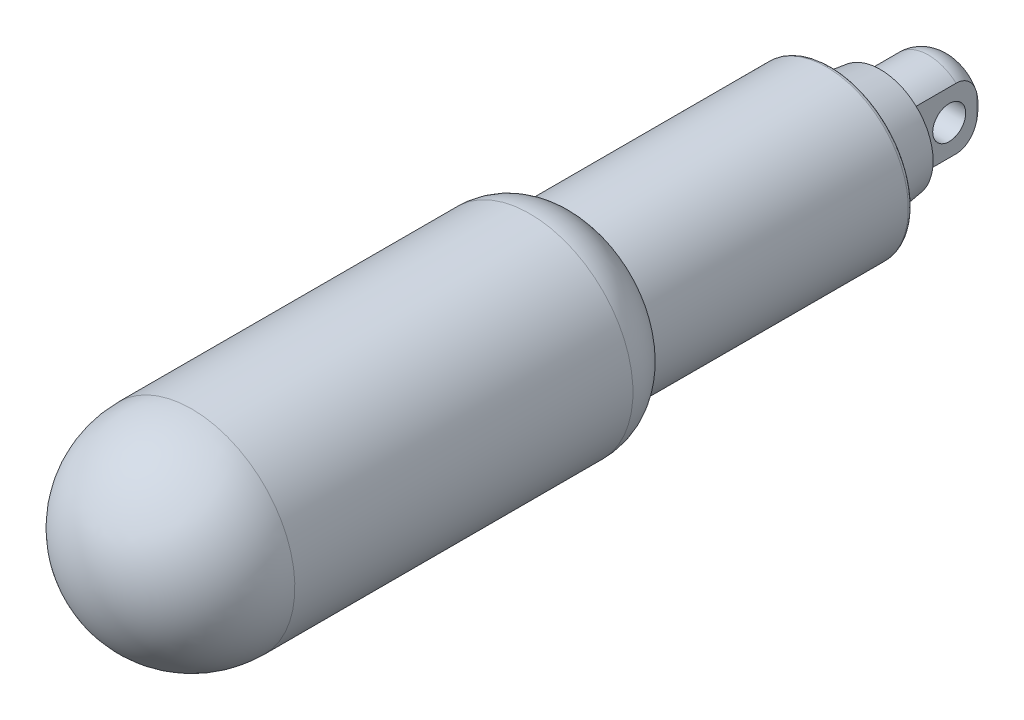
ISO-10303-21;
HEADER;
FILE_DESCRIPTION(('STEP AP214'),'2;1');
FILE_NAME('part.step','',(''),(''),'','','');
FILE_SCHEMA(('AUTOMOTIVE_DESIGN { 1 0 10303 214 1 1 1 1 }'));
ENDSEC;
DATA;
#1=APPLICATION_CONTEXT('core data for automotive mechanical design processes');
#2=APPLICATION_PROTOCOL_DEFINITION('international standard','automotive_design',2000,#1);
#3=PRODUCT_CONTEXT('',#1,'mechanical');
#4=PRODUCT('Part','Part','',(#3));
#5=PRODUCT_RELATED_PRODUCT_CATEGORY('part','',(#4));
#6=PRODUCT_DEFINITION_FORMATION('','',#4);
#7=PRODUCT_DEFINITION_CONTEXT('part definition',#1,'design');
#8=PRODUCT_DEFINITION('design','',#6,#7);
#9=PRODUCT_DEFINITION_SHAPE('','',#8);
#10=(LENGTH_UNIT() NAMED_UNIT(*) SI_UNIT(.MILLI.,.METRE.));
#11=(NAMED_UNIT(*) PLANE_ANGLE_UNIT() SI_UNIT($,.RADIAN.));
#12=(NAMED_UNIT(*) SI_UNIT($,.STERADIAN.) SOLID_ANGLE_UNIT());
#13=UNCERTAINTY_MEASURE_WITH_UNIT(LENGTH_MEASURE(1.E-05),#10,'distance_accuracy_value','');
#14=(GEOMETRIC_REPRESENTATION_CONTEXT(3) GLOBAL_UNCERTAINTY_ASSIGNED_CONTEXT((#13)) GLOBAL_UNIT_ASSIGNED_CONTEXT((#10,
#11,#12)) REPRESENTATION_CONTEXT('',''));
#15=CARTESIAN_POINT('',(0.,0.,0.));
#16=DIRECTION('',(0.,0.,1.));
#17=DIRECTION('',(1.,0.,0.));
#18=AXIS2_PLACEMENT_3D('',#15,#16,#17);
#19=CARTESIAN_POINT('',(0.,-1.,-3.8333333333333));
#20=DIRECTION('',(0.,0.,-1.));
#21=DIRECTION('',(0.,1.,0.));
#22=AXIS2_PLACEMENT_3D('',#19,#20,#21);
#23=PLANE('',#22);
#24=CARTESIAN_POINT('',(0.,0.,-3.8333333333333));
#25=DIRECTION('',(0.,0.,1.));
#26=DIRECTION('',(-1.,0.,0.));
#27=AXIS2_PLACEMENT_3D('',#24,#25,#26);
#28=CIRCLE('',#27,1.99999999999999);
#29=CARTESIAN_POINT('',(-2.,0.,-3.8333333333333));
#30=VERTEX_POINT('',#29);
#31=CARTESIAN_POINT('',(0.,-2.,-3.8333333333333));
#32=VERTEX_POINT('',#31);
#33=EDGE_CURVE('E186',#30,#32,#28,.T.);
#34=ORIENTED_EDGE('',*,*,#33,.F.);
#35=CARTESIAN_POINT('',(0.,0.,-3.8333333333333));
#36=DIRECTION('',(0.,0.,1.));
#37=DIRECTION('',(1.,0.,0.));
#38=AXIS2_PLACEMENT_3D('',#35,#36,#37);
#39=CIRCLE('',#38,2.);
#40=CARTESIAN_POINT('',(2.,0.,-3.8333333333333));
#41=VERTEX_POINT('',#40);
#42=EDGE_CURVE('E81',#41,#30,#39,.T.);
#43=ORIENTED_EDGE('',*,*,#42,.F.);
#44=CARTESIAN_POINT('',(0.,0.,-3.8333333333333));
#45=DIRECTION('',(0.,0.,1.));
#46=DIRECTION('',(0.,-1.,0.));
#47=AXIS2_PLACEMENT_3D('',#44,#45,#46);
#48=CIRCLE('',#47,1.99999999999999);
#49=EDGE_CURVE('E182',#32,#41,#48,.T.);
#50=ORIENTED_EDGE('',*,*,#49,.F.);
#51=EDGE_LOOP('',(#34,#43,#50));
#52=FACE_BOUND('',#51,.T.);
#53=ADVANCED_FACE('F14',(#52),#23,.T.);
#54=CARTESIAN_POINT('',(2.85,12.5,-3.3333333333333));
#55=DIRECTION('',(0.,1.,0.));
#56=DIRECTION('',(-1.,0.,0.));
#57=AXIS2_PLACEMENT_3D('',#54,#55,#56);
#58=CYLINDRICAL_SURFACE('',#57,0.5);
#59=DIRECTION('',(0.,1.,0.));
#60=VECTOR('',#59,1.);
#61=CARTESIAN_POINT('',(3.35,12.5,-3.3333333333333));
#62=LINE('',#61,#60);
#63=CARTESIAN_POINT('',(3.35,1.4699488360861,-3.3333333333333));
#64=VERTEX_POINT('',#63);
#65=CARTESIAN_POINT('',(3.35,-1.46994883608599,-3.3333333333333));
#66=VERTEX_POINT('',#65);
#67=EDGE_CURVE('E112',#64,#66,#62,.F.);
#68=ORIENTED_EDGE('',*,*,#67,.T.);
#69=CARTESIAN_POINT('',(3.35,1.4699488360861,-3.3333333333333));
#70=CARTESIAN_POINT('',(3.34998929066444,1.38900390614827,-3.35493138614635));
#71=CARTESIAN_POINT('',(3.34860257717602,1.30767154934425,-3.37502525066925));
#72=CARTESIAN_POINT('',(3.34413889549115,1.14428987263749,-3.41190932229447));
#73=CARTESIAN_POINT('',(3.34106162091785,1.06224042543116,-3.42869892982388));
#74=CARTESIAN_POINT('',(3.33428000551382,0.897527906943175,-3.45866823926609));
#75=CARTESIAN_POINT('',(3.33057578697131,0.814864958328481,-3.47184864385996));
#76=CARTESIAN_POINT('',(3.32348196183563,0.649026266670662,-3.49444080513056));
#77=CARTESIAN_POINT('',(3.32009229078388,0.565850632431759,-3.50385333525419));
#78=CARTESIAN_POINT('',(3.31450016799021,0.402301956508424,-3.51853373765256));
#79=CARTESIAN_POINT('',(3.31225727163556,0.321943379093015,-3.52394634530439));
#80=CARTESIAN_POINT('',(3.30921472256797,0.161056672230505,-3.53116512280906));
#81=CARTESIAN_POINT('',(3.30841468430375,0.0805285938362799,-3.53297225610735));
#82=CARTESIAN_POINT('',(3.30841532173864,-0.0838132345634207,-3.53297221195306));
#83=CARTESIAN_POINT('',(3.30928261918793,-0.167627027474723,-3.53101460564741));
#84=CARTESIAN_POINT('',(3.31256869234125,-0.335052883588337,-3.5231958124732));
#85=CARTESIAN_POINT('',(3.31498772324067,-0.418664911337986,-3.51733398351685));
#86=CARTESIAN_POINT('',(3.3208576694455,-0.585559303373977,-3.50174352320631));
#87=CARTESIAN_POINT('',(3.3243094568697,-0.668841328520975,-3.49201162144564));
#88=CARTESIAN_POINT('',(3.33145710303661,-0.834855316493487,-3.46878134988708));
#89=CARTESIAN_POINT('',(3.3351529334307,-0.917587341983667,-3.45528341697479));
#90=CARTESIAN_POINT('',(3.34169421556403,-1.07900850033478,-3.42532265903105));
#91=CARTESIAN_POINT('',(3.34456848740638,-1.15772347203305,-3.40900533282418));
#92=CARTESIAN_POINT('',(3.34871587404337,-1.31439309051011,-3.37336000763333));
#93=CARTESIAN_POINT('',(3.34999123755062,-1.3923486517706,-3.35403627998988));
#94=CARTESIAN_POINT('',(3.35,-1.46994883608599,-3.3333333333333));
#95=B_SPLINE_CURVE_WITH_KNOTS('',3,(#69,#70,#71,#72,#73,#74,#75,#76,#77,#78,#79,#80,#81,#82,#83,
#84,#85,#86,#87,#88,#89,#90,#91,#92,#93,#94),.UNSPECIFIED.,.F.,.F.,(4,2,2,2,2,2,2,2,2,2,2,2,4),
(0.,0.251288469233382,0.502622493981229,0.753907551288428,1.00514099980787,1.24676672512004,
1.48832787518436,1.73974194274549,1.99119736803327,2.24286573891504,2.49450492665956,
2.73574984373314,2.97665509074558),.UNSPECIFIED.);
#96=EDGE_CURVE('E80',#64,#66,#95,.T.);
#97=ORIENTED_EDGE('',*,*,#96,.F.);
#98=EDGE_LOOP('',(#68,#97));
#99=FACE_BOUND('',#98,.T.);
#100=ADVANCED_FACE('F227',(#99),#58,.T.);
#101=CARTESIAN_POINT('',(-12.5,0.,0.));
#102=DIRECTION('',(-1.,0.,0.));
#103=DIRECTION('',(0.,-1.,0.));
#104=AXIS2_PLACEMENT_3D('',#101,#102,#103);
#105=CYLINDRICAL_SURFACE('',#104,2.);
#106=CARTESIAN_POINT('',(-3.35,0.,0.));
#107=DIRECTION('',(-1.,0.,0.));
#108=DIRECTION('',(0.,-1.,0.));
#109=AXIS2_PLACEMENT_3D('',#106,#107,#108);
#110=CIRCLE('',#109,2.);
#111=CARTESIAN_POINT('',(-3.35,-2.,0.));
#112=VERTEX_POINT('',#111);
#113=EDGE_CURVE('E92',#112,#112,#110,.T.);
#114=ORIENTED_EDGE('',*,*,#113,.T.);
#115=EDGE_LOOP('',(#114));
#116=FACE_BOUND('',#115,.T.);
#117=CARTESIAN_POINT('',(3.35,0.,0.));
#118=DIRECTION('',(-1.,0.,0.));
#119=DIRECTION('',(0.,-1.,0.));
#120=AXIS2_PLACEMENT_3D('',#117,#118,#119);
#121=CIRCLE('',#120,2.);
#122=CARTESIAN_POINT('',(3.35,-2.,0.));
#123=VERTEX_POINT('',#122);
#124=EDGE_CURVE('E218',#123,#123,#121,.F.);
#125=ORIENTED_EDGE('',*,*,#124,.T.);
#126=EDGE_LOOP('',(#125));
#127=FACE_BOUND('',#126,.T.);
#128=ADVANCED_FACE('F241',(#116,#127),#105,.F.);
#129=CARTESIAN_POINT('',(-2.85,12.5,-3.3333333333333));
#130=DIRECTION('',(0.,1.,0.));
#131=DIRECTION('',(-1.,0.,0.));
#132=AXIS2_PLACEMENT_3D('',#129,#130,#131);
#133=CYLINDRICAL_SURFACE('',#132,0.5);
#134=DIRECTION('',(0.,1.,0.));
#135=VECTOR('',#134,1.);
#136=CARTESIAN_POINT('',(-3.35,12.5,-3.3333333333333));
#137=LINE('',#136,#135);
#138=CARTESIAN_POINT('',(-3.35,-1.46994883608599,-3.3333333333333));
#139=VERTEX_POINT('',#138);
#140=CARTESIAN_POINT('',(-3.35,1.4699488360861,-3.3333333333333));
#141=VERTEX_POINT('',#140);
#142=EDGE_CURVE('E77',#139,#141,#137,.T.);
#143=ORIENTED_EDGE('',*,*,#142,.T.);
#144=CARTESIAN_POINT('',(-3.35,-1.46994883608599,-3.3333333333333));
#145=CARTESIAN_POINT('',(-3.34998929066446,-1.38900390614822,-3.35493138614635));
#146=CARTESIAN_POINT('',(-3.34860257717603,-1.30767154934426,-3.37502525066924));
#147=CARTESIAN_POINT('',(-3.34413889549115,-1.14428987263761,-3.41190932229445));
#148=CARTESIAN_POINT('',(-3.34106162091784,-1.06224042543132,-3.42869892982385));
#149=CARTESIAN_POINT('',(-3.33428000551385,-0.897527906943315,-3.45866823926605));
#150=CARTESIAN_POINT('',(-3.33057578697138,-0.814864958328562,-3.47184864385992));
#151=CARTESIAN_POINT('',(-3.32348196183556,-0.649026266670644,-3.49444080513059));
#152=CARTESIAN_POINT('',(-3.32009229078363,-0.565850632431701,-3.5038533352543));
#153=CARTESIAN_POINT('',(-3.31450016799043,-0.402301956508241,-3.51853373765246));
#154=CARTESIAN_POINT('',(-3.3122572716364,-0.321943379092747,-3.52394634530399));
#155=CARTESIAN_POINT('',(-3.30921472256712,-0.161056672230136,-3.53116512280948));
#156=CARTESIAN_POINT('',(-3.3084146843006,-0.0805285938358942,-3.53297225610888));
#157=CARTESIAN_POINT('',(-3.30841532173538,0.0838132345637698,-3.53297221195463));
#158=CARTESIAN_POINT('',(-3.30928261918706,0.167627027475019,-3.53101460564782));
#159=CARTESIAN_POINT('',(-3.31256869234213,0.33505288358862,-3.52319581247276));
#160=CARTESIAN_POINT('',(-3.31498772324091,0.418664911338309,-3.51733398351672));
#161=CARTESIAN_POINT('',(-3.32085766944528,0.585559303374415,-3.50174352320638));
#162=CARTESIAN_POINT('',(-3.32430945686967,0.668841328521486,-3.49201162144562));
#163=CARTESIAN_POINT('',(-3.33145710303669,0.834855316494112,-3.46878134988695));
#164=CARTESIAN_POINT('',(-3.33515293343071,0.917587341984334,-3.45528341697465));
#165=CARTESIAN_POINT('',(-3.341694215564,1.07900850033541,-3.42532265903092));
#166=CARTESIAN_POINT('',(-3.34456848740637,1.15772347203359,-3.40900533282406));
#167=CARTESIAN_POINT('',(-3.3487158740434,1.31439309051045,-3.37336000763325));
#168=CARTESIAN_POINT('',(-3.34999123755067,1.39234865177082,-3.35403627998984));
#169=CARTESIAN_POINT('',(-3.35,1.4699488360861,-3.3333333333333));
#170=B_SPLINE_CURVE_WITH_KNOTS('',3,(#144,#145,#146,#147,#148,#149,#150,#151,#152,#153,#154,
#155,#156,#157,#158,#159,#160,#161,#162,#163,#164,#165,#166,#167,#168,#169),.UNSPECIFIED.,.F.,
.F.,(4,2,2,2,2,2,2,2,2,2,2,2,4),(0.,0.251288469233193,0.502622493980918,0.753907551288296,
1.00514099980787,1.24676672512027,1.48832787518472,1.73974194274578,1.99119736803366,
2.24286573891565,2.49450492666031,2.73574984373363,2.97665509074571),.UNSPECIFIED.);
#171=EDGE_CURVE('E73',#139,#141,#170,.T.);
#172=ORIENTED_EDGE('',*,*,#171,.F.);
#173=EDGE_LOOP('',(#143,#172));
#174=FACE_BOUND('',#173,.T.);
#175=ADVANCED_FACE('F75',(#174),#133,.T.);
#176=CARTESIAN_POINT('',(2.,0.,-0.833333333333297));
#177=DIRECTION('',(0.,1.,0.));
#178=DIRECTION('',(1.,0.,0.));
#179=AXIS2_PLACEMENT_3D('',#176,#177,#178);
#180=CIRCLE('',#179,3.);
#181=TRIMMED_CURVE('',#180,(PARAMETER_VALUE(-2.30052398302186)),
(PARAMETER_VALUE(2.30052398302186)),.T.,.PARAMETER.);
#182=CARTESIAN_POINT('',(0.,0.,-0.833333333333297));
#183=DIRECTION('',(0.,0.,1.));
#184=AXIS1_PLACEMENT('',#182,#183);
#185=SURFACE_OF_REVOLUTION('',#181,#184);
#186=ORIENTED_EDGE('',*,*,#49,.T.);
#187=ORIENTED_EDGE('',*,*,#42,.T.);
#188=ORIENTED_EDGE('',*,*,#33,.T.);
#189=EDGE_LOOP('',(#186,#187,#188));
#190=FACE_BOUND('',#189,.T.);
#191=CARTESIAN_POINT('',(3.35,3.7118054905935,-0.833333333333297));
#192=CARTESIAN_POINT('',(3.35,3.71181699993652,-0.898983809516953));
#193=CARTESIAN_POINT('',(3.35,3.70890287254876,-0.964628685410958));
#194=CARTESIAN_POINT('',(3.35,3.69731152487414,-1.09539068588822));
#195=CARTESIAN_POINT('',(3.35,3.68863583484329,-1.16050794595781));
#196=CARTESIAN_POINT('',(3.35,3.66564391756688,-1.28954015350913));
#197=CARTESIAN_POINT('',(3.35,3.65134465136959,-1.35345811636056));
#198=CARTESIAN_POINT('',(3.35,3.61728742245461,-1.47980535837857));
#199=CARTESIAN_POINT('',(3.35,3.59752931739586,-1.54223459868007));
#200=CARTESIAN_POINT('',(3.35,3.53039604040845,-1.72655798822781));
#201=CARTESIAN_POINT('',(3.35,3.47512824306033,-1.84567318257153));
#202=CARTESIAN_POINT('',(3.35,3.34601528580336,-2.07315001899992));
#203=CARTESIAN_POINT('',(3.35,3.27217686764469,-2.18151554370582));
#204=CARTESIAN_POINT('',(3.35,3.10638007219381,-2.38857272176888));
#205=CARTESIAN_POINT('',(3.35,3.01395529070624,-2.48688920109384));
#206=CARTESIAN_POINT('',(3.35,2.81547339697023,-2.66916085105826));
#207=CARTESIAN_POINT('',(3.35,2.70937634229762,-2.75307219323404));
#208=CARTESIAN_POINT('',(3.35,2.51267240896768,-2.88832802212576));
#209=CARTESIAN_POINT('',(3.35,2.42412552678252,-2.94272212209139));
#210=CARTESIAN_POINT('',(3.35,2.24220900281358,-3.0429808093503));
#211=CARTESIAN_POINT('',(3.35,2.14883402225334,-3.08883568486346));
#212=CARTESIAN_POINT('',(3.35,1.95916659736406,-3.17209275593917));
#213=CARTESIAN_POINT('',(3.35,1.86289751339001,-3.20954881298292));
#214=CARTESIAN_POINT('',(3.35,1.66801090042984,-3.27690781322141));
#215=CARTESIAN_POINT('',(3.35,1.56939985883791,-3.30682944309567));
#216=CARTESIAN_POINT('',(3.35,1.4699488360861,-3.3333333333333));
#217=B_SPLINE_CURVE_WITH_KNOTS('',3,(#191,#192,#193,#194,#195,#196,#197,#198,#199,#200,#201,
#202,#203,#204,#205,#206,#207,#208,#209,#210,#211,#212,#213,#214,#215,#216),.UNSPECIFIED.,.F.,
.F.,(4,2,2,2,2,2,2,2,2,2,2,2,4),(0.,0.196877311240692,0.39370235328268,0.589938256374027,
0.786179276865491,1.17810350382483,1.56988565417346,1.97311519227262,2.3775506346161,
2.68884218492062,3.00048563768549,3.31006941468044,3.61887763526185),.UNSPECIFIED.);
#218=CARTESIAN_POINT('',(3.35,3.7118054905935,-0.833333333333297));
#219=VERTEX_POINT('',#218);
#220=EDGE_CURVE('E115',#219,#64,#217,.T.);
#221=ORIENTED_EDGE('',*,*,#220,.T.);
#222=ORIENTED_EDGE('',*,*,#96,.T.);
#223=CARTESIAN_POINT('',(3.35,-1.46994883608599,-3.3333333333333));
#224=CARTESIAN_POINT('',(3.35,-1.57131407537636,-3.30631962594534));
#225=CARTESIAN_POINT('',(3.35,-1.67180900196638,-3.27575414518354));
#226=CARTESIAN_POINT('',(3.35,-1.87035880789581,-3.20680122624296));
#227=CARTESIAN_POINT('',(3.35,-1.9684066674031,-3.16839366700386));
#228=CARTESIAN_POINT('',(3.35,-2.1616117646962,-3.08282400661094));
#229=CARTESIAN_POINT('',(3.35,-2.25673885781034,-3.03559297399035));
#230=CARTESIAN_POINT('',(3.35,-2.44187911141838,-2.93220009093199));
#231=CARTESIAN_POINT('',(3.34999999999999,-2.53189790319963,-2.87604834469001));
#232=CARTESIAN_POINT('',(3.35000000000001,-2.74020068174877,-2.73026422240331));
#233=CARTESIAN_POINT('',(3.35000000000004,-2.8554502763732,-2.63620758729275));
#234=CARTESIAN_POINT('',(3.34999999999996,-3.06877640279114,-2.43070307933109));
#235=CARTESIAN_POINT('',(3.34999999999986,-3.16690835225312,-2.31931362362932));
#236=CARTESIAN_POINT('',(3.34999999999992,-3.29852465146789,-2.14016991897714));
#237=CARTESIAN_POINT('',(3.34999999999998,-3.33994980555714,-2.07814013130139));
#238=CARTESIAN_POINT('',(3.35000000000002,-3.41690061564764,-1.95053694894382));
#239=CARTESIAN_POINT('',(3.35000000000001,-3.45242904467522,-1.8849652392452));
#240=CARTESIAN_POINT('',(3.34999999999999,-3.51712122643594,-1.75072528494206));
#241=CARTESIAN_POINT('',(3.35,-3.54628310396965,-1.6820561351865));
#242=CARTESIAN_POINT('',(3.35,-3.59780943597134,-1.54224910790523));
#243=CARTESIAN_POINT('',(3.35,-3.62017631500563,-1.4711121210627));
#244=CARTESIAN_POINT('',(3.35,-3.66306023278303,-1.30676769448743));
#245=CARTESIAN_POINT('',(3.35,-3.68131096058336,-1.21295123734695));
#246=CARTESIAN_POINT('',(3.35,-3.69959048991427,-1.07115023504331));
#247=CARTESIAN_POINT('',(3.35,-3.70416757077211,-1.02370682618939));
#248=CARTESIAN_POINT('',(3.35,-3.71027518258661,-0.928625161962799));
#249=CARTESIAN_POINT('',(3.35,-3.71180576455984,-0.880986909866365));
#250=CARTESIAN_POINT('',(3.35,-3.71180549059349,-0.833333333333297));
#251=B_SPLINE_CURVE_WITH_KNOTS('',3,(#223,#224,#225,#226,#227,#228,#229,#230,#231,#232,#233,
#234,#235,#236,#237,#238,#239,#240,#241,#242,#243,#244,#245,#246,#247,#248,#249,#250),
.UNSPECIFIED.,.F.,.F.,(4,2,2,2,2,2,2,2,2,2,2,2,2,4),(0.,0.314755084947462,0.630328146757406,
0.94847829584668,1.26627062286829,1.71072428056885,2.1537111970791,2.37721575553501,
2.60061490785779,2.8240797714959,3.04746480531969,3.33331667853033,3.47622487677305,
3.61913068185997),.UNSPECIFIED.);
#252=CARTESIAN_POINT('',(3.35,-3.71180549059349,-0.833333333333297));
#253=VERTEX_POINT('',#252);
#254=EDGE_CURVE('E111',#66,#253,#251,.T.);
#255=ORIENTED_EDGE('',*,*,#254,.T.);
#256=CARTESIAN_POINT('',(0.,0.,-0.833333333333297));
#257=DIRECTION('',(0.,0.,-1.));
#258=DIRECTION('',(-1.,0.,0.));
#259=AXIS2_PLACEMENT_3D('',#256,#257,#258);
#260=CIRCLE('',#259,5.);
#261=CARTESIAN_POINT('',(-3.35,-3.71180549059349,-0.833333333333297));
#262=VERTEX_POINT('',#261);
#263=EDGE_CURVE('E88',#262,#253,#260,.F.);
#264=ORIENTED_EDGE('',*,*,#263,.F.);
#265=CARTESIAN_POINT('',(-3.35,-3.71180549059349,-0.833333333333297));
#266=CARTESIAN_POINT('',(-3.35,-3.71181699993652,-0.898983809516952));
#267=CARTESIAN_POINT('',(-3.35,-3.70890287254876,-0.964628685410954));
#268=CARTESIAN_POINT('',(-3.35,-3.69731152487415,-1.09539068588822));
#269=CARTESIAN_POINT('',(-3.35,-3.68863583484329,-1.1605079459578));
#270=CARTESIAN_POINT('',(-3.35,-3.66564391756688,-1.28954015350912));
#271=CARTESIAN_POINT('',(-3.35,-3.6513446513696,-1.35345811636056));
#272=CARTESIAN_POINT('',(-3.35,-3.61728742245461,-1.47980535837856));
#273=CARTESIAN_POINT('',(-3.35,-3.59752931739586,-1.54223459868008));
#274=CARTESIAN_POINT('',(-3.35,-3.53039604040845,-1.7265579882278));
#275=CARTESIAN_POINT('',(-3.35,-3.47512824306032,-1.8456731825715));
#276=CARTESIAN_POINT('',(-3.35,-3.34601528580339,-2.07315001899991));
#277=CARTESIAN_POINT('',(-3.35,-3.27217686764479,-2.18151554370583));
#278=CARTESIAN_POINT('',(-3.35,-3.10638007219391,-2.38857272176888));
#279=CARTESIAN_POINT('',(-3.35,-3.0139552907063,-2.48688920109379));
#280=CARTESIAN_POINT('',(-3.35,-2.81547339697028,-2.66916085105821));
#281=CARTESIAN_POINT('',(-3.35,-2.70937634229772,-2.75307219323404));
#282=CARTESIAN_POINT('',(-3.35,-2.51267240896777,-2.88832802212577));
#283=CARTESIAN_POINT('',(-3.35,-2.42412552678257,-2.94272212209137));
#284=CARTESIAN_POINT('',(-3.35,-2.24220900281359,-3.04298080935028));
#285=CARTESIAN_POINT('',(-3.35,-2.14883402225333,-3.08883568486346));
#286=CARTESIAN_POINT('',(-3.35,-1.95916659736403,-3.17209275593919));
#287=CARTESIAN_POINT('',(-3.35,-1.86289751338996,-3.20954881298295));
#288=CARTESIAN_POINT('',(-3.35,-1.66801090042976,-3.27690781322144));
#289=CARTESIAN_POINT('',(-3.35,-1.56939985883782,-3.30682944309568));
#290=CARTESIAN_POINT('',(-3.35,-1.46994883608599,-3.3333333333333));
#291=B_SPLINE_CURVE_WITH_KNOTS('',3,(#265,#266,#267,#268,#269,#270,#271,#272,#273,#274,#275,
#276,#277,#278,#279,#280,#281,#282,#283,#284,#285,#286,#287,#288,#289,#290),.UNSPECIFIED.,.F.,
.F.,(4,2,2,2,2,2,2,2,2,2,2,2,4),(0.,0.196877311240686,0.393702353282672,0.589938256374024,
0.786179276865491,1.17810350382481,1.5698856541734,1.97311519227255,2.37755063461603,
2.6888421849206,3.00048563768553,3.31006941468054,3.61887763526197),.UNSPECIFIED.);
#292=EDGE_CURVE('E84',#262,#139,#291,.T.);
#293=ORIENTED_EDGE('',*,*,#292,.T.);
#294=ORIENTED_EDGE('',*,*,#171,.T.);
#295=CARTESIAN_POINT('',(-3.35,1.4699488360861,-3.3333333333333));
#296=CARTESIAN_POINT('',(-3.35,1.57131407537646,-3.30631962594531));
#297=CARTESIAN_POINT('',(-3.35,1.67180900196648,-3.27575414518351));
#298=CARTESIAN_POINT('',(-3.35,1.87035880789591,-3.20680122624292));
#299=CARTESIAN_POINT('',(-3.35,1.9684066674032,-3.16839366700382));
#300=CARTESIAN_POINT('',(-3.35,2.1616117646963,-3.08282400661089));
#301=CARTESIAN_POINT('',(-3.35,2.25673885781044,-3.0355929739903));
#302=CARTESIAN_POINT('',(-3.35,2.44187911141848,-2.93220009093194));
#303=CARTESIAN_POINT('',(-3.34999999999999,2.53189790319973,-2.87604834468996));
#304=CARTESIAN_POINT('',(-3.35000000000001,2.74020068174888,-2.73026422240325));
#305=CARTESIAN_POINT('',(-3.35000000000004,2.85545027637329,-2.63620758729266));
#306=CARTESIAN_POINT('',(-3.34999999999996,3.06877640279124,-2.43070307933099));
#307=CARTESIAN_POINT('',(-3.34999999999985,3.16690835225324,-2.31931362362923));
#308=CARTESIAN_POINT('',(-3.34999999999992,3.29852465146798,-2.14016991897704));
#309=CARTESIAN_POINT('',(-3.34999999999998,3.33994980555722,-2.07814013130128));
#310=CARTESIAN_POINT('',(-3.35000000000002,3.41690061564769,-1.95053694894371));
#311=CARTESIAN_POINT('',(-3.35000000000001,3.45242904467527,-1.88496523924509));
#312=CARTESIAN_POINT('',(-3.34999999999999,3.51712122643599,-1.75072528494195));
#313=CARTESIAN_POINT('',(-3.35,3.5462831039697,-1.68205613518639));
#314=CARTESIAN_POINT('',(-3.35,3.59780943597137,-1.54224910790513));
#315=CARTESIAN_POINT('',(-3.35,3.62017631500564,-1.4711121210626));
#316=CARTESIAN_POINT('',(-3.35,3.66306023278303,-1.30676769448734));
#317=CARTESIAN_POINT('',(-3.35,3.68131096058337,-1.21295123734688));
#318=CARTESIAN_POINT('',(-3.35,3.69959048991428,-1.07115023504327));
#319=CARTESIAN_POINT('',(-3.35,3.70416757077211,-1.02370682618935));
#320=CARTESIAN_POINT('',(-3.35,3.71027518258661,-0.928625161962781));
#321=CARTESIAN_POINT('',(-3.35,3.71180576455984,-0.880986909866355));
#322=CARTESIAN_POINT('',(-3.35,3.7118054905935,-0.833333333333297));
#323=B_SPLINE_CURVE_WITH_KNOTS('',3,(#295,#296,#297,#298,#299,#300,#301,#302,#303,#304,#305,
#306,#307,#308,#309,#310,#311,#312,#313,#314,#315,#316,#317,#318,#319,#320,#321,#322),
.UNSPECIFIED.,.F.,.F.,(4,2,2,2,2,2,2,2,2,2,2,2,2,4),(0.,0.314755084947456,0.630328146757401,
0.948478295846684,1.2662706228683,1.71072428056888,2.15371119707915,2.37721575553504,
2.60061490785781,2.82407977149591,3.04746480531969,3.33331667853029,3.47622487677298,
3.61913068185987),.UNSPECIFIED.);
#324=CARTESIAN_POINT('',(-3.35,3.7118054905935,-0.833333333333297));
#325=VERTEX_POINT('',#324);
#326=EDGE_CURVE('E98',#141,#325,#323,.T.);
#327=ORIENTED_EDGE('',*,*,#326,.T.);
#328=CARTESIAN_POINT('',(0.,0.,-0.833333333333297));
#329=DIRECTION('',(0.,0.,-1.));
#330=DIRECTION('',(-1.,0.,0.));
#331=AXIS2_PLACEMENT_3D('',#328,#329,#330);
#332=CIRCLE('',#331,5.);
#333=EDGE_CURVE('E108',#219,#325,#332,.F.);
#334=ORIENTED_EDGE('',*,*,#333,.F.);
#335=EDGE_LOOP('',(#221,#222,#255,#264,#293,#294,#327,#334));
#336=FACE_BOUND('',#335,.T.);
#337=ADVANCED_FACE('F86',(#190,#336),#185,.F.);
#338=CARTESIAN_POINT('',(0.,0.,2.08333333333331));
#339=DIRECTION('',(0.,0.,-1.));
#340=DIRECTION('',(-1.,0.,0.));
#341=AXIS2_PLACEMENT_3D('',#338,#339,#340);
#342=CYLINDRICAL_SURFACE('',#341,5.);
#343=DIRECTION('',(0.,0.,1.));
#344=VECTOR('',#343,1.);
#345=CARTESIAN_POINT('',(3.35,-3.7118054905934,-3.3333333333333));
#346=LINE('',#345,#344);
#347=CARTESIAN_POINT('',(3.35,-3.71180549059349,5.));
#348=VERTEX_POINT('',#347);
#349=EDGE_CURVE('E109',#253,#348,#346,.T.);
#350=ORIENTED_EDGE('',*,*,#349,.T.);
#351=CARTESIAN_POINT('',(0.,0.,5.));
#352=DIRECTION('',(0.,0.,-1.));
#353=DIRECTION('',(-1.,0.,0.));
#354=AXIS2_PLACEMENT_3D('',#351,#352,#353);
#355=CIRCLE('',#354,5.);
#356=CARTESIAN_POINT('',(-3.35,-3.71180549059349,5.));
#357=VERTEX_POINT('',#356);
#358=EDGE_CURVE('E390',#357,#348,#355,.F.);
#359=ORIENTED_EDGE('',*,*,#358,.F.);
#360=DIRECTION('',(0.,0.,-1.));
#361=VECTOR('',#360,1.);
#362=CARTESIAN_POINT('',(-3.35,-3.7118054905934,5.));
#363=LINE('',#362,#361);
#364=EDGE_CURVE('E391',#357,#262,#363,.T.);
#365=ORIENTED_EDGE('',*,*,#364,.T.);
#366=ORIENTED_EDGE('',*,*,#263,.T.);
#367=EDGE_LOOP('',(#350,#359,#365,#366));
#368=FACE_BOUND('',#367,.T.);
#369=ADVANCED_FACE('F128',(#368),#342,.T.);
#370=CARTESIAN_POINT('',(3.35,12.5,-3.3333333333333));
#371=DIRECTION('',(-1.,0.,0.));
#372=DIRECTION('',(0.,0.,1.));
#373=AXIS2_PLACEMENT_3D('',#370,#371,#372);
#374=PLANE('',#373);
#375=ORIENTED_EDGE('',*,*,#254,.F.);
#376=ORIENTED_EDGE('',*,*,#67,.F.);
#377=ORIENTED_EDGE('',*,*,#220,.F.);
#378=DIRECTION('',(0.,0.,-1.));
#379=VECTOR('',#378,1.);
#380=CARTESIAN_POINT('',(3.35,3.7118054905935,2.08333333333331));
#381=LINE('',#380,#379);
#382=CARTESIAN_POINT('',(3.35,3.7118054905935,5.));
#383=VERTEX_POINT('',#382);
#384=EDGE_CURVE('E105',#383,#219,#381,.T.);
#385=ORIENTED_EDGE('',*,*,#384,.F.);
#386=DIRECTION('',(0.,1.,0.));
#387=VECTOR('',#386,1.);
#388=CARTESIAN_POINT('',(3.35,-5.7,5.));
#389=LINE('',#388,#387);
#390=EDGE_CURVE('E388',#348,#383,#389,.T.);
#391=ORIENTED_EDGE('',*,*,#390,.F.);
#392=ORIENTED_EDGE('',*,*,#349,.F.);
#393=EDGE_LOOP('',(#375,#376,#377,#385,#391,#392));
#394=FACE_BOUND('',#393,.T.);
#395=ORIENTED_EDGE('',*,*,#124,.F.);
#396=EDGE_LOOP('',(#395));
#397=FACE_BOUND('',#396,.T.);
#398=ADVANCED_FACE('F229',(#394,#397),#374,.F.);
#399=CARTESIAN_POINT('',(0.,0.,2.08333333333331));
#400=DIRECTION('',(0.,0.,-1.));
#401=DIRECTION('',(-1.,0.,0.));
#402=AXIS2_PLACEMENT_3D('',#399,#400,#401);
#403=CYLINDRICAL_SURFACE('',#402,5.);
#404=DIRECTION('',(0.,0.,-1.));
#405=VECTOR('',#404,1.);
#406=CARTESIAN_POINT('',(-3.35,3.7118054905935,5.));
#407=LINE('',#406,#405);
#408=CARTESIAN_POINT('',(-3.35,3.7118054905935,5.));
#409=VERTEX_POINT('',#408);
#410=EDGE_CURVE('E100',#325,#409,#407,.F.);
#411=ORIENTED_EDGE('',*,*,#410,.T.);
#412=CARTESIAN_POINT('',(0.,0.,5.));
#413=DIRECTION('',(0.,0.,-1.));
#414=DIRECTION('',(-1.,0.,0.));
#415=AXIS2_PLACEMENT_3D('',#412,#413,#414);
#416=CIRCLE('',#415,5.);
#417=EDGE_CURVE('E387',#383,#409,#416,.F.);
#418=ORIENTED_EDGE('',*,*,#417,.F.);
#419=ORIENTED_EDGE('',*,*,#384,.T.);
#420=ORIENTED_EDGE('',*,*,#333,.T.);
#421=EDGE_LOOP('',(#411,#418,#419,#420));
#422=FACE_BOUND('',#421,.T.);
#423=ADVANCED_FACE('F251',(#422),#403,.T.);
#424=CARTESIAN_POINT('',(-3.35,12.5,5.));
#425=DIRECTION('',(1.,0.,0.));
#426=DIRECTION('',(0.,0.,-1.));
#427=AXIS2_PLACEMENT_3D('',#424,#425,#426);
#428=PLANE('',#427);
#429=DIRECTION('',(0.,1.,0.));
#430=VECTOR('',#429,1.);
#431=CARTESIAN_POINT('',(-3.35,-5.7,5.));
#432=LINE('',#431,#430);
#433=EDGE_CURVE('E378',#409,#357,#432,.F.);
#434=ORIENTED_EDGE('',*,*,#433,.F.);
#435=ORIENTED_EDGE('',*,*,#410,.F.);
#436=ORIENTED_EDGE('',*,*,#326,.F.);
#437=ORIENTED_EDGE('',*,*,#142,.F.);
#438=ORIENTED_EDGE('',*,*,#292,.F.);
#439=ORIENTED_EDGE('',*,*,#364,.F.);
#440=EDGE_LOOP('',(#434,#435,#436,#437,#438,#439));
#441=FACE_BOUND('',#440,.T.);
#442=ORIENTED_EDGE('',*,*,#113,.F.);
#443=EDGE_LOOP('',(#442));
#444=FACE_BOUND('',#443,.T.);
#445=ADVANCED_FACE('F95',(#441,#444),#428,.F.);
#446=CARTESIAN_POINT('',(0.,-5.7,5.));
#447=DIRECTION('',(0.,0.,-1.));
#448=DIRECTION('',(-1.,0.,0.));
#449=AXIS2_PLACEMENT_3D('',#446,#447,#448);
#450=PLANE('',#449);
#451=CARTESIAN_POINT('',(0.,0.,4.99999999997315));
#452=DIRECTION('',(0.,0.,1.));
#453=DIRECTION('',(1.,0.,0.));
#454=AXIS2_PLACEMENT_3D('',#451,#452,#453);
#455=CIRCLE('',#454,6.40000000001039);
#456=CARTESIAN_POINT('',(6.40000000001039,0.,4.99999999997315));
#457=VERTEX_POINT('',#456);
#458=EDGE_CURVE('E373',#457,#457,#455,.T.);
#459=ORIENTED_EDGE('',*,*,#458,.F.);
#460=EDGE_LOOP('',(#459));
#461=FACE_BOUND('',#460,.T.);
#462=ORIENTED_EDGE('',*,*,#417,.T.);
#463=ORIENTED_EDGE('',*,*,#433,.T.);
#464=ORIENTED_EDGE('',*,*,#358,.T.);
#465=ORIENTED_EDGE('',*,*,#390,.T.);
#466=EDGE_LOOP('',(#462,#463,#464,#465));
#467=FACE_BOUND('',#466,.T.);
#468=ADVANCED_FACE('F250',(#461,#467),#450,.T.);
#469=CARTESIAN_POINT('',(0.,0.,9.955669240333));
#470=DIRECTION('',(0.,0.,1.));
#471=DIRECTION('',(1.,0.,0.));
#472=AXIS2_PLACEMENT_3D('',#469,#470,#471);
#473=CONICAL_SURFACE('',#472,7.09647389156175,0.139626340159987);
#474=CARTESIAN_POINT('',(0.,0.,9.955669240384));
#475=DIRECTION('',(0.,0.,1.));
#476=DIRECTION('',(1.,0.,0.));
#477=AXIS2_PLACEMENT_3D('',#474,#475,#476);
#478=CIRCLE('',#477,7.09647389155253);
#479=CARTESIAN_POINT('',(7.09647389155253,0.,9.955669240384));
#480=VERTEX_POINT('',#479);
#481=EDGE_CURVE('E371',#480,#480,#478,.F.);
#482=ORIENTED_EDGE('',*,*,#481,.T.);
#483=EDGE_LOOP('',(#482));
#484=FACE_BOUND('',#483,.T.);
#485=ORIENTED_EDGE('',*,*,#458,.T.);
#486=EDGE_LOOP('',(#485));
#487=FACE_BOUND('',#486,.T.);
#488=ADVANCED_FACE('F481',(#484,#487),#473,.T.);
#489=CARTESIAN_POINT('',(0.,0.,9.9));
#490=DIRECTION('',(0.,0.,1.));
#491=DIRECTION('',(1.,0.,0.));
#492=AXIS2_PLACEMENT_3D('',#489,#490,#491);
#493=TOROIDAL_SURFACE('',#492,7.4925811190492,0.4);
#494=ORIENTED_EDGE('',*,*,#481,.F.);
#495=EDGE_LOOP('',(#494));
#496=FACE_BOUND('',#495,.T.);
#497=CARTESIAN_POINT('',(0.,0.,10.3));
#498=DIRECTION('',(0.,0.,-1.));
#499=DIRECTION('',(-1.,0.,0.));
#500=AXIS2_PLACEMENT_3D('',#497,#498,#499);
#501=CIRCLE('',#500,7.49258111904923);
#502=CARTESIAN_POINT('',(7.4925811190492,0.,10.3));
#503=VERTEX_POINT('',#502);
#504=CARTESIAN_POINT('',(-7.4925811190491,0.,10.3));
#505=VERTEX_POINT('',#504);
#506=EDGE_CURVE('E363',#503,#505,#501,.F.);
#507=ORIENTED_EDGE('',*,*,#506,.F.);
#508=CARTESIAN_POINT('',(0.,0.,10.3));
#509=DIRECTION('',(0.,0.,-1.));
#510=DIRECTION('',(1.,0.,0.));
#511=AXIS2_PLACEMENT_3D('',#508,#509,#510);
#512=CIRCLE('',#511,7.49258111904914);
#513=CARTESIAN_POINT('',(0.,-7.4925811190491,10.3));
#514=VERTEX_POINT('',#513);
#515=EDGE_CURVE('E326',#514,#503,#512,.F.);
#516=ORIENTED_EDGE('',*,*,#515,.F.);
#517=CARTESIAN_POINT('',(0.,0.,10.3));
#518=DIRECTION('',(0.,0.,-1.));
#519=DIRECTION('',(0.,-1.,0.));
#520=AXIS2_PLACEMENT_3D('',#517,#518,#519);
#521=CIRCLE('',#520,7.49258111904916);
#522=EDGE_CURVE('E359',#505,#514,#521,.F.);
#523=ORIENTED_EDGE('',*,*,#522,.F.);
#524=EDGE_LOOP('',(#507,#516,#523));
#525=FACE_BOUND('',#524,.T.);
#526=ADVANCED_FACE('F342',(#496,#525),#493,.F.);
#527=CARTESIAN_POINT('',(0.,-7.74629055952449,10.3));
#528=DIRECTION('',(0.,0.,-1.));
#529=DIRECTION('',(-1.,0.,0.));
#530=AXIS2_PLACEMENT_3D('',#527,#528,#529);
#531=PLANE('',#530);
#532=ORIENTED_EDGE('',*,*,#506,.T.);
#533=ORIENTED_EDGE('',*,*,#522,.T.);
#534=ORIENTED_EDGE('',*,*,#515,.T.);
#535=EDGE_LOOP('',(#532,#533,#534));
#536=FACE_BOUND('',#535,.T.);
#537=CARTESIAN_POINT('',(0.,0.,10.3));
#538=DIRECTION('',(0.,0.,-1.));
#539=DIRECTION('',(-1.,0.,0.));
#540=AXIS2_PLACEMENT_3D('',#537,#538,#539);
#541=CIRCLE('',#540,8.);
#542=CARTESIAN_POINT('',(-8.,0.,10.3));
#543=VERTEX_POINT('',#542);
#544=EDGE_CURVE('E367',#543,#543,#541,.F.);
#545=ORIENTED_EDGE('',*,*,#544,.F.);
#546=EDGE_LOOP('',(#545));
#547=FACE_BOUND('',#546,.T.);
#548=ADVANCED_FACE('F332',(#536,#547),#531,.T.);
#549=CARTESIAN_POINT('',(0.,0.,10.65));
#550=DIRECTION('',(0.,0.,-1.));
#551=DIRECTION('',(-1.,0.,0.));
#552=AXIS2_PLACEMENT_3D('',#549,#550,#551);
#553=CYLINDRICAL_SURFACE('',#552,8.);
#554=CARTESIAN_POINT('',(0.,0.,11.));
#555=DIRECTION('',(0.,0.,-1.));
#556=DIRECTION('',(-1.,0.,0.));
#557=AXIS2_PLACEMENT_3D('',#554,#555,#556);
#558=CIRCLE('',#557,8.);
#559=CARTESIAN_POINT('',(-8.,0.,11.));
#560=VERTEX_POINT('',#559);
#561=EDGE_CURVE('E369',#560,#560,#558,.F.);
#562=ORIENTED_EDGE('',*,*,#561,.F.);
#563=EDGE_LOOP('',(#562));
#564=FACE_BOUND('',#563,.T.);
#565=ORIENTED_EDGE('',*,*,#544,.T.);
#566=EDGE_LOOP('',(#565));
#567=FACE_BOUND('',#566,.T.);
#568=ADVANCED_FACE('F341',(#564,#567),#553,.T.);
#569=CARTESIAN_POINT('',(0.,-8.6999999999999,11.));
#570=DIRECTION('',(0.,0.,-1.));
#571=DIRECTION('',(0.,1.,0.));
#572=AXIS2_PLACEMENT_3D('',#569,#570,#571);
#573=PLANE('',#572);
#574=ORIENTED_EDGE('',*,*,#561,.T.);
#575=EDGE_LOOP('',(#574));
#576=FACE_BOUND('',#575,.T.);
#577=CARTESIAN_POINT('',(0.,0.,11.));
#578=DIRECTION('',(0.,0.,1.));
#579=DIRECTION('',(-1.,0.,0.));
#580=AXIS2_PLACEMENT_3D('',#577,#578,#579);
#581=CIRCLE('',#580,9.39999999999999);
#582=CARTESIAN_POINT('',(-9.4,0.,11.));
#583=VERTEX_POINT('',#582);
#584=CARTESIAN_POINT('',(0.,-9.3999999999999,11.));
#585=VERTEX_POINT('',#584);
#586=EDGE_CURVE('E402',#583,#585,#581,.T.);
#587=ORIENTED_EDGE('',*,*,#586,.F.);
#588=CARTESIAN_POINT('',(0.,0.,11.));
#589=DIRECTION('',(0.,0.,1.));
#590=DIRECTION('',(1.,0.,0.));
#591=AXIS2_PLACEMENT_3D('',#588,#589,#590);
#592=CIRCLE('',#591,9.4);
#593=CARTESIAN_POINT('',(9.4,0.,11.));
#594=VERTEX_POINT('',#593);
#595=EDGE_CURVE('E398',#594,#583,#592,.T.);
#596=ORIENTED_EDGE('',*,*,#595,.F.);
#597=CARTESIAN_POINT('',(0.,0.,11.));
#598=DIRECTION('',(0.,0.,1.));
#599=DIRECTION('',(0.,-1.,0.));
#600=AXIS2_PLACEMENT_3D('',#597,#598,#599);
#601=CIRCLE('',#600,9.39999999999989);
#602=EDGE_CURVE('E407',#585,#594,#601,.T.);
#603=ORIENTED_EDGE('',*,*,#602,.F.);
#604=EDGE_LOOP('',(#587,#596,#603));
#605=FACE_BOUND('',#604,.T.);
#606=ADVANCED_FACE('F297',(#576,#605),#573,.T.);
#607=CARTESIAN_POINT('',(0.,0.,11.5));
#608=DIRECTION('',(0.,0.,1.));
#609=DIRECTION('',(1.,0.,0.));
#610=AXIS2_PLACEMENT_3D('',#607,#608,#609);
#611=TOROIDAL_SURFACE('',#610,9.4,0.5);
#612=CARTESIAN_POINT('',(0.,0.,11.5));
#613=DIRECTION('',(0.,0.,-1.));
#614=DIRECTION('',(-1.,0.,0.));
#615=AXIS2_PLACEMENT_3D('',#612,#613,#614);
#616=CIRCLE('',#615,9.9);
#617=CARTESIAN_POINT('',(-9.9,0.,11.5));
#618=VERTEX_POINT('',#617);
#619=EDGE_CURVE('E287',#618,#618,#616,.F.);
#620=ORIENTED_EDGE('',*,*,#619,.F.);
#621=EDGE_LOOP('',(#620));
#622=FACE_BOUND('',#621,.T.);
#623=ORIENTED_EDGE('',*,*,#586,.T.);
#624=ORIENTED_EDGE('',*,*,#602,.T.);
#625=ORIENTED_EDGE('',*,*,#595,.T.);
#626=EDGE_LOOP('',(#623,#624,#625));
#627=FACE_BOUND('',#626,.T.);
#628=ADVANCED_FACE('F292',(#622,#627),#611,.T.);
#629=CARTESIAN_POINT('',(0.,0.,26.9));
#630=DIRECTION('',(0.,0.,-1.));
#631=DIRECTION('',(-1.,0.,0.));
#632=AXIS2_PLACEMENT_3D('',#629,#630,#631);
#633=CYLINDRICAL_SURFACE('',#632,9.9);
#634=CARTESIAN_POINT('',(0.,0.,42.3));
#635=DIRECTION('',(0.,0.,1.));
#636=DIRECTION('',(1.,0.,0.));
#637=AXIS2_PLACEMENT_3D('',#634,#635,#636);
#638=CIRCLE('',#637,9.9);
#639=CARTESIAN_POINT('',(9.9,0.,42.3));
#640=VERTEX_POINT('',#639);
#641=EDGE_CURVE('E284',#640,#640,#638,.T.);
#642=ORIENTED_EDGE('',*,*,#641,.F.);
#643=EDGE_LOOP('',(#642));
#644=FACE_BOUND('',#643,.T.);
#645=ORIENTED_EDGE('',*,*,#619,.T.);
#646=EDGE_LOOP('',(#645));
#647=FACE_BOUND('',#646,.T.);
#648=ADVANCED_FACE('F296',(#644,#647),#633,.T.);
#649=CARTESIAN_POINT('',(6.,0.,47.5));
#650=DIRECTION('',(0.,1.,0.));
#651=DIRECTION('',(1.,0.,0.));
#652=AXIS2_PLACEMENT_3D('',#649,#650,#651);
#653=CIRCLE('',#652,6.5);
#654=TRIMMED_CURVE('',#653,(PARAMETER_VALUE(-2.74680153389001)),
(PARAMETER_VALUE(2.74680153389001)),.T.,.PARAMETER.);
#655=CARTESIAN_POINT('',(0.,0.,47.5));
#656=DIRECTION('',(0.,0.,1.));
#657=AXIS1_PLACEMENT('',#655,#656);
#658=SURFACE_OF_REVOLUTION('',#654,#657);
#659=ORIENTED_EDGE('',*,*,#641,.T.);
#660=EDGE_LOOP('',(#659));
#661=FACE_BOUND('',#660,.T.);
#662=CARTESIAN_POINT('',(0.,0.,47.5));
#663=DIRECTION('',(0.,0.,-1.));
#664=DIRECTION('',(-1.,0.,0.));
#665=AXIS2_PLACEMENT_3D('',#662,#663,#664);
#666=CIRCLE('',#665,12.5);
#667=CARTESIAN_POINT('',(-12.5,0.,47.5));
#668=VERTEX_POINT('',#667);
#669=EDGE_CURVE('E26',#668,#668,#666,.F.);
#670=ORIENTED_EDGE('',*,*,#669,.F.);
#671=EDGE_LOOP('',(#670));
#672=FACE_BOUND('',#671,.T.);
#673=ADVANCED_FACE('F270',(#661,#672),#658,.F.);
#674=CARTESIAN_POINT('',(0.,0.,88.5));
#675=DIRECTION('',(0.,0.,1.));
#676=DIRECTION('',(0.,1.,0.));
#677=AXIS2_PLACEMENT_3D('',#674,#675,#676);
#678=SPHERICAL_SURFACE('',#677,12.5);
#679=CARTESIAN_POINT('',(0.,0.,101.));
#680=VERTEX_POINT('',#679);
#681=VERTEX_LOOP('',#680);
#682=FACE_BOUND('',#681,.T.);
#683=CARTESIAN_POINT('',(0.,0.,88.5));
#684=DIRECTION('',(0.,0.,-1.));
#685=DIRECTION('',(-1.,0.,0.));
#686=AXIS2_PLACEMENT_3D('',#683,#684,#685);
#687=CIRCLE('',#686,12.5);
#688=CARTESIAN_POINT('',(-12.5,0.,88.5));
#689=VERTEX_POINT('',#688);
#690=EDGE_CURVE('E9',#689,#689,#687,.T.);
#691=ORIENTED_EDGE('',*,*,#690,.F.);
#692=EDGE_LOOP('',(#691));
#693=FACE_BOUND('',#692,.T.);
#694=ADVANCED_FACE('F263',(#682,#693),#678,.T.);
#695=CARTESIAN_POINT('',(0.,0.,68.));
#696=DIRECTION('',(0.,0.,-1.));
#697=DIRECTION('',(-1.,0.,0.));
#698=AXIS2_PLACEMENT_3D('',#695,#696,#697);
#699=CYLINDRICAL_SURFACE('',#698,12.5);
#700=ORIENTED_EDGE('',*,*,#669,.T.);
#701=EDGE_LOOP('',(#700));
#702=FACE_BOUND('',#701,.T.);
#703=ORIENTED_EDGE('',*,*,#690,.T.);
#704=EDGE_LOOP('',(#703));
#705=FACE_BOUND('',#704,.T.);
#706=ADVANCED_FACE('F261',(#702,#705),#699,.T.);
#707=CLOSED_SHELL('',(#53,#100,#128,#175,#337,#369,#398,#423,#445,#468,#488,#526,#548,#568,#606,
#628,#648,#673,#694,#706));
#708=MANIFOLD_SOLID_BREP('B1',#707);
#709=ADVANCED_BREP_SHAPE_REPRESENTATION('',(#18,#708),#14);
#710=SHAPE_DEFINITION_REPRESENTATION(#9,#709);
ENDSEC;
END-ISO-10303-21;
